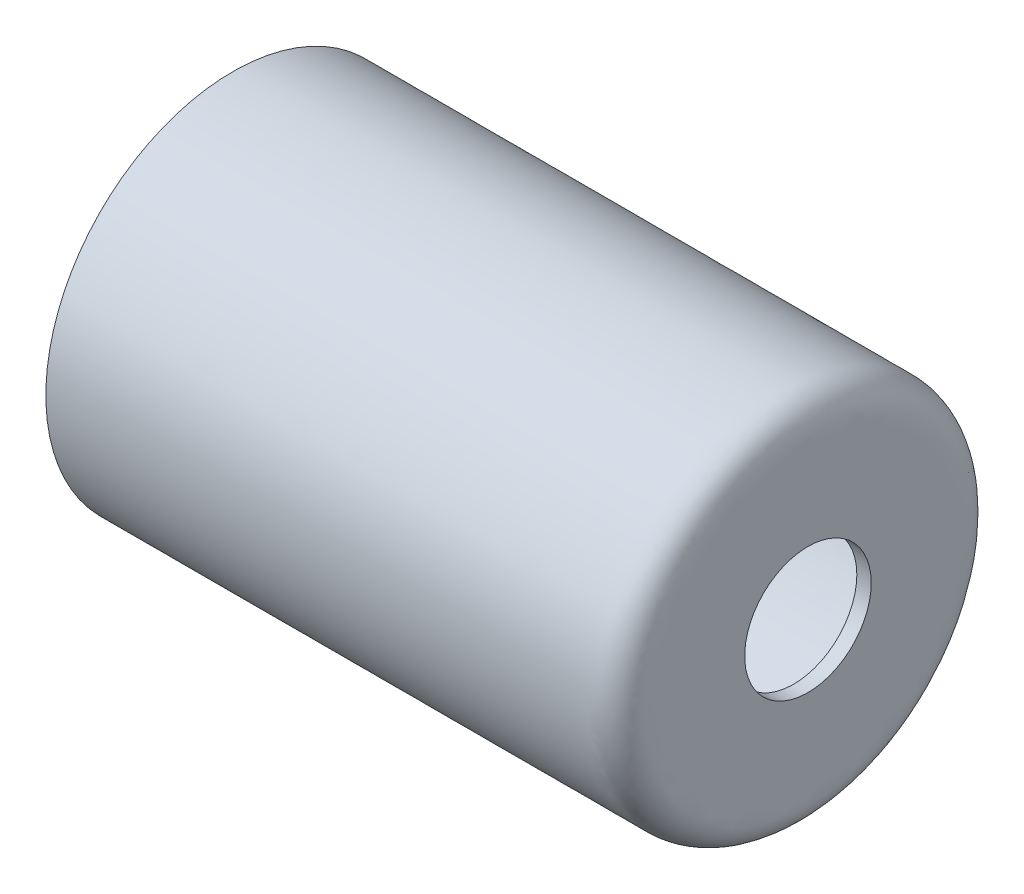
ISO-10303-21;
HEADER;
FILE_DESCRIPTION(('STEP AP214'),'2;1');
FILE_NAME('part.step','',(''),(''),'','','');
FILE_SCHEMA(('AUTOMOTIVE_DESIGN { 1 0 10303 214 1 1 1 1 }'));
ENDSEC;
DATA;
#1=APPLICATION_CONTEXT('core data for automotive mechanical design processes');
#2=APPLICATION_PROTOCOL_DEFINITION('international standard','automotive_design',2000,#1);
#3=PRODUCT_CONTEXT('',#1,'mechanical');
#4=PRODUCT('Part','Part','',(#3));
#5=PRODUCT_RELATED_PRODUCT_CATEGORY('part','',(#4));
#6=PRODUCT_DEFINITION_FORMATION('','',#4);
#7=PRODUCT_DEFINITION_CONTEXT('part definition',#1,'design');
#8=PRODUCT_DEFINITION('design','',#6,#7);
#9=PRODUCT_DEFINITION_SHAPE('','',#8);
#10=(LENGTH_UNIT() NAMED_UNIT(*) SI_UNIT(.MILLI.,.METRE.));
#11=(NAMED_UNIT(*) PLANE_ANGLE_UNIT() SI_UNIT($,.RADIAN.));
#12=(NAMED_UNIT(*) SI_UNIT($,.STERADIAN.) SOLID_ANGLE_UNIT());
#13=UNCERTAINTY_MEASURE_WITH_UNIT(LENGTH_MEASURE(1.E-05),#10,'distance_accuracy_value','');
#14=(GEOMETRIC_REPRESENTATION_CONTEXT(3) GLOBAL_UNCERTAINTY_ASSIGNED_CONTEXT((#13)) GLOBAL_UNIT_ASSIGNED_CONTEXT((#10,
#11,#12)) REPRESENTATION_CONTEXT('',''));
#15=CARTESIAN_POINT('',(0.,0.,0.));
#16=DIRECTION('',(0.,0.,1.));
#17=DIRECTION('',(1.,0.,0.));
#18=AXIS2_PLACEMENT_3D('',#15,#16,#17);
#19=CARTESIAN_POINT('',(0.,3.25,0.));
#20=CARTESIAN_POINT('',(3.12887068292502,3.25,0.));
#21=CARTESIAN_POINT('',(6.25774136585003,3.25,0.));
#22=CARTESIAN_POINT('',(9.38661204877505,3.25,0.));
#23=CARTESIAN_POINT('',(9.39921071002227,3.25,0.));
#24=CARTESIAN_POINT('',(9.42440803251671,3.25,0.));
#25=CARTESIAN_POINT('',(9.46220401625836,3.25,0.));
#26=CARTESIAN_POINT('',(9.4874013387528,3.25,0.));
#27=CARTESIAN_POINT('',(9.50000000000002,3.25,0.));
#28=CARTESIAN_POINT('',(9.51265247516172,3.25,0.));
#29=CARTESIAN_POINT('',(9.53795742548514,3.25,0.));
#30=CARTESIAN_POINT('',(9.57594120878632,3.24468587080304,0.));
#31=CARTESIAN_POINT('',(9.60080723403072,3.23989589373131,0.));
#32=CARTESIAN_POINT('',(9.61313158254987,3.23703310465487,0.));
#33=CARTESIAN_POINT('',(9.80407104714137,3.19268030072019,0.));
#34=CARTESIAN_POINT('',(9.94268030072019,3.05407104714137,0.));
#35=CARTESIAN_POINT('',(9.98703310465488,2.86313158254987,0.));
#36=CARTESIAN_POINT('',(9.98989589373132,2.85080723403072,0.));
#37=CARTESIAN_POINT('',(9.99468587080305,2.82594120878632,0.));
#38=CARTESIAN_POINT('',(10.,2.78795742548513,0.));
#39=CARTESIAN_POINT('',(10.,2.76265247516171,0.));
#40=CARTESIAN_POINT('',(10.,2.75,0.));
#41=CARTESIAN_POINT('',(10.,2.73740133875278,0.));
#42=CARTESIAN_POINT('',(10.,2.71220401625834,0.));
#43=CARTESIAN_POINT('',(10.,2.67440803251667,0.));
#44=CARTESIAN_POINT('',(10.,2.64921071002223,0.));
#45=CARTESIAN_POINT('',(10.,2.63661204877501,0.));
#46=CARTESIAN_POINT('',(10.,2.12440803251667,0.));
#47=CARTESIAN_POINT('',(10.,1.61220401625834,0.));
#48=CARTESIAN_POINT('',(10.,1.1,0.));
#49=(BOUNDED_CURVE() B_SPLINE_CURVE(3,(#19,#20,#21,#22,#23,#24,#25,#26,#27,#28,#29,#30,#31,#32,
#33,#34,#35,#36,#37,#38,#39,#40,#41,#42,#43,#44,#45,#46,#47,#48),.UNSPECIFIED.,.F.,
.F.) B_SPLINE_CURVE_WITH_KNOTS((4,3,1,1,3,1,1,3,3,1,1,3,1,1,3,4),(0.,0.788358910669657,
0.791533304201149,0.794707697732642,0.797882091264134,0.801070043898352,0.80425799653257,
0.807445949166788,0.851856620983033,0.855044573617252,0.858232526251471,0.861420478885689,
0.864594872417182,0.867769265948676,0.870943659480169,1.),
.UNSPECIFIED.) CURVE() GEOMETRIC_REPRESENTATION_ITEM() RATIONAL_B_SPLINE_CURVE((1.,1.,1.,1.,1.,
1.,1.,1.,1.,1.,1.,1.,1.,1.,0.899174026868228,0.899174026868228,1.,1.,1.,1.,1.,1.,1.,1.,1.,1.,1.,
1.,1.,1.)) REPRESENTATION_ITEM(''));
#50=CARTESIAN_POINT('',(10.5885363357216,0.,0.));
#51=DIRECTION('',(1.,0.,0.));
#52=AXIS1_PLACEMENT('',#50,#51);
#53=SURFACE_OF_REVOLUTION('',#49,#52);
#54=CARTESIAN_POINT('',(10.,0.,0.));
#55=DIRECTION('',(1.,0.,0.));
#56=DIRECTION('',(0.,0.,-1.));
#57=AXIS2_PLACEMENT_3D('',#54,#55,#56);
#58=CIRCLE('',#57,1.1);
#59=CARTESIAN_POINT('',(10.,0.,-1.1));
#60=VERTEX_POINT('',#59);
#61=EDGE_CURVE('E45',#60,#60,#58,.T.);
#62=ORIENTED_EDGE('',*,*,#61,.F.);
#63=EDGE_LOOP('',(#62));
#64=FACE_BOUND('',#63,.T.);
#65=CARTESIAN_POINT('',(0.,0.,0.));
#66=DIRECTION('',(1.,0.,0.));
#67=DIRECTION('',(0.,0.,-1.));
#68=AXIS2_PLACEMENT_3D('',#65,#66,#67);
#69=CIRCLE('',#68,3.25);
#70=CARTESIAN_POINT('',(0.,0.,-3.25));
#71=VERTEX_POINT('',#70);
#72=EDGE_CURVE('E10',#71,#71,#69,.T.);
#73=ORIENTED_EDGE('',*,*,#72,.T.);
#74=EDGE_LOOP('',(#73));
#75=FACE_BOUND('',#74,.T.);
#76=ADVANCED_FACE('F30',(#64,#75),#53,.T.);
#77=CARTESIAN_POINT('',(0.,3.25,0.));
#78=DIRECTION('',(-1.,0.,0.));
#79=DIRECTION('',(0.,0.,1.));
#80=AXIS2_PLACEMENT_3D('',#77,#78,#79);
#81=PLANE('',#80);
#82=CARTESIAN_POINT('',(0.,0.,0.));
#83=DIRECTION('',(1.,0.,0.));
#84=DIRECTION('',(0.,0.,-1.));
#85=AXIS2_PLACEMENT_3D('',#82,#83,#84);
#86=CIRCLE('',#85,3.);
#87=CARTESIAN_POINT('',(0.,0.,-3.));
#88=VERTEX_POINT('',#87);
#89=EDGE_CURVE('E37',#88,#88,#86,.T.);
#90=ORIENTED_EDGE('',*,*,#89,.T.);
#91=EDGE_LOOP('',(#90));
#92=FACE_BOUND('',#91,.T.);
#93=ORIENTED_EDGE('',*,*,#72,.F.);
#94=EDGE_LOOP('',(#93));
#95=FACE_BOUND('',#94,.T.);
#96=ADVANCED_FACE('F64',(#92,#95),#81,.T.);
#97=CARTESIAN_POINT('',(0.,3.,0.));
#98=CARTESIAN_POINT('',(1.98442019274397,3.,0.));
#99=CARTESIAN_POINT('',(4.96105048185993,3.,0.));
#100=CARTESIAN_POINT('',(8.06170703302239,3.,0.));
#101=CARTESIAN_POINT('',(9.23995652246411,3.,0.));
#102=CARTESIAN_POINT('',(9.42599591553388,3.,0.));
#103=CARTESIAN_POINT('',(9.50351232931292,3.,0.));
#104=CARTESIAN_POINT('',(9.51749765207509,2.99990082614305,0.));
#105=CARTESIAN_POINT('',(9.52136710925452,2.99967687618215,0.));
#106=CARTESIAN_POINT('',(9.52224754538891,2.99960219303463,0.));
#107=CARTESIAN_POINT('',(9.52836507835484,2.99880097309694,0.));
#108=CARTESIAN_POINT('',(9.53326810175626,2.99804200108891,0.));
#109=CARTESIAN_POINT('',(9.5578567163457,2.99377897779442,0.));
#110=CARTESIAN_POINT('',(9.57083429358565,2.99028778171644,0.));
#111=CARTESIAN_POINT('',(9.64592728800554,2.96283014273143,0.));
#112=CARTESIAN_POINT('',(9.70080066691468,2.9124711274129,0.));
#113=CARTESIAN_POINT('',(9.73435554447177,2.83854992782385,0.));
#114=CARTESIAN_POINT('',(9.73949317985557,2.82337798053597,0.));
#115=CARTESIAN_POINT('',(9.74492439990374,2.80071849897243,0.));
#116=CARTESIAN_POINT('',(9.74682176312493,2.79082812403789,0.));
#117=CARTESIAN_POINT('',(9.7489797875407,2.77719124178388,0.));
#118=CARTESIAN_POINT('',(9.74939356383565,2.77393363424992,0.));
#119=CARTESIAN_POINT('',(9.74977400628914,2.77022841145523,0.));
#120=CARTESIAN_POINT('',(9.74977832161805,2.77032862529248,0.));
#121=CARTESIAN_POINT('',(9.75005265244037,2.76080800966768,0.));
#122=CARTESIAN_POINT('',(9.75000000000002,2.74334797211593,0.));
#123=CARTESIAN_POINT('',(9.75000000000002,2.71234140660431,0.));
#124=CARTESIAN_POINT('',(9.75000000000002,2.66583155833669,0.));
#125=CARTESIAN_POINT('',(9.75000000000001,2.12321666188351,0.));
#126=CARTESIAN_POINT('',(9.75000000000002,1.59610504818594,0.));
#127=CARTESIAN_POINT('',(9.75000000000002,1.1,0.));
#128=B_SPLINE_CURVE_WITH_KNOTS('',3,(#97,#98,#99,#100,#101,#102,#103,#104,#105,#106,#107,#108,
#109,#110,#111,#112,#113,#114,#115,#116,#117,#118,#119,#120,#121,#122,#123,#124,#125,#126,#127),
.UNSPECIFIED.,.F.,.F.,(4,1,1,1,2,2,2,2,2,2,2,2,2,2,2,1,1,4),(0.,0.499999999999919,
0.749999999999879,0.781249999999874,0.796874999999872,0.800781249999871,0.802734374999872,
0.804687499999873,0.812499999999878,0.843749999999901,0.851562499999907,0.85546874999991,
0.857421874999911,0.859374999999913,0.863281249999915,0.867187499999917,0.874999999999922,1.),.UNSPECIFIED.);
#129=CARTESIAN_POINT('',(10.5885363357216,0.,0.));
#130=DIRECTION('',(1.,0.,0.));
#131=AXIS1_PLACEMENT('',#129,#130);
#132=SURFACE_OF_REVOLUTION('',#128,#131);
#133=CARTESIAN_POINT('',(9.75000000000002,0.,0.));
#134=DIRECTION('',(1.,0.,0.));
#135=DIRECTION('',(0.,0.,-1.));
#136=AXIS2_PLACEMENT_3D('',#133,#134,#135);
#137=CIRCLE('',#136,1.1);
#138=CARTESIAN_POINT('',(9.75000000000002,0.,-1.1));
#139=VERTEX_POINT('',#138);
#140=EDGE_CURVE('E41',#139,#139,#137,.T.);
#141=ORIENTED_EDGE('',*,*,#140,.T.);
#142=EDGE_LOOP('',(#141));
#143=FACE_BOUND('',#142,.T.);
#144=ORIENTED_EDGE('',*,*,#89,.F.);
#145=EDGE_LOOP('',(#144));
#146=FACE_BOUND('',#145,.T.);
#147=ADVANCED_FACE('F60',(#143,#146),#132,.F.);
#148=CARTESIAN_POINT('',(10.5885363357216,0.,0.));
#149=DIRECTION('',(1.,0.,0.));
#150=DIRECTION('',(0.,0.,-1.));
#151=AXIS2_PLACEMENT_3D('',#148,#149,#150);
#152=CYLINDRICAL_SURFACE('',#151,1.1);
#153=ORIENTED_EDGE('',*,*,#61,.T.);
#154=EDGE_LOOP('',(#153));
#155=FACE_BOUND('',#154,.T.);
#156=ORIENTED_EDGE('',*,*,#140,.F.);
#157=EDGE_LOOP('',(#156));
#158=FACE_BOUND('',#157,.T.);
#159=ADVANCED_FACE('F63',(#155,#158),#152,.F.);
#160=CLOSED_SHELL('',(#76,#96,#147,#159));
#161=MANIFOLD_SOLID_BREP('B2',#160);
#162=ADVANCED_BREP_SHAPE_REPRESENTATION('',(#18,#161),#14);
#163=SHAPE_DEFINITION_REPRESENTATION(#9,#162);
ENDSEC;
END-ISO-10303-21;
